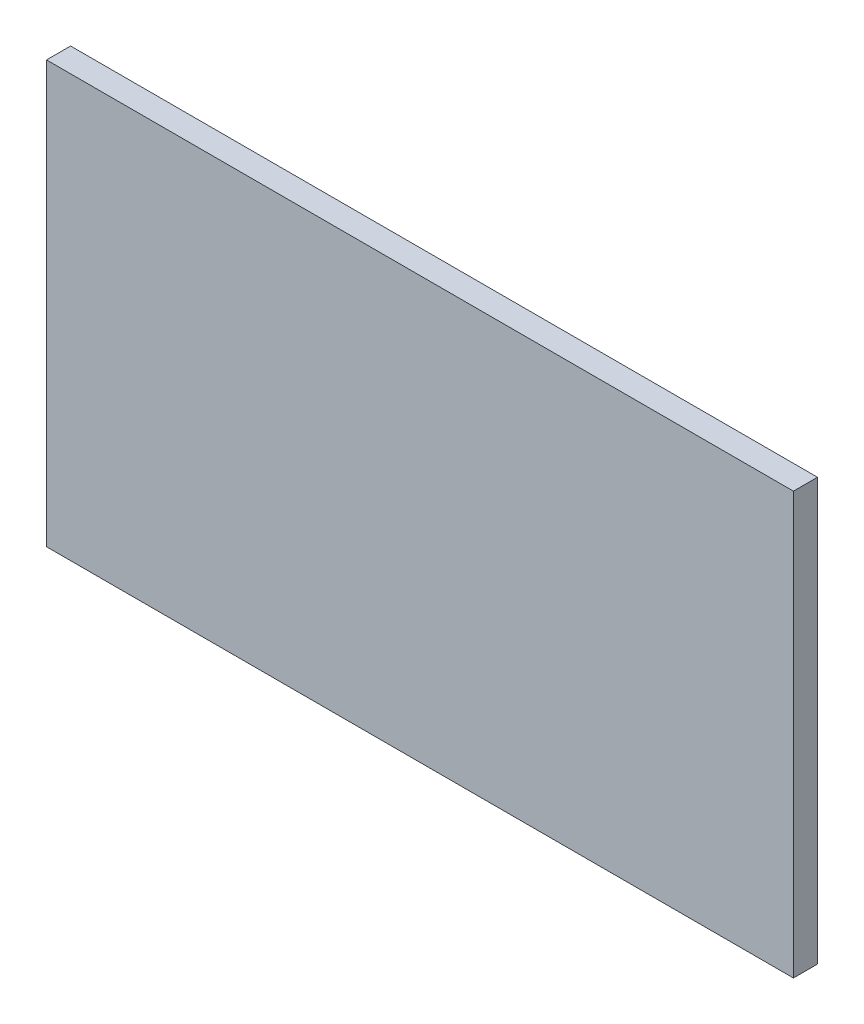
from build123d import *

# Parameters (mm, degrees)
ESQUISSE1_W        = 620
ESQUISSE1_H        = 350
BOSS_EXTRU_1_DEPTH = 10


with BuildPart() as part:
    # Esquisse1 → Boss.-Extru.1 (new, symmetric)
    with BuildSketch(Plane.XY):
        Rectangle(ESQUISSE1_W, ESQUISSE1_H)
    extrude(amount=BOSS_EXTRU_1_DEPTH, both=True)


solid = part.part
